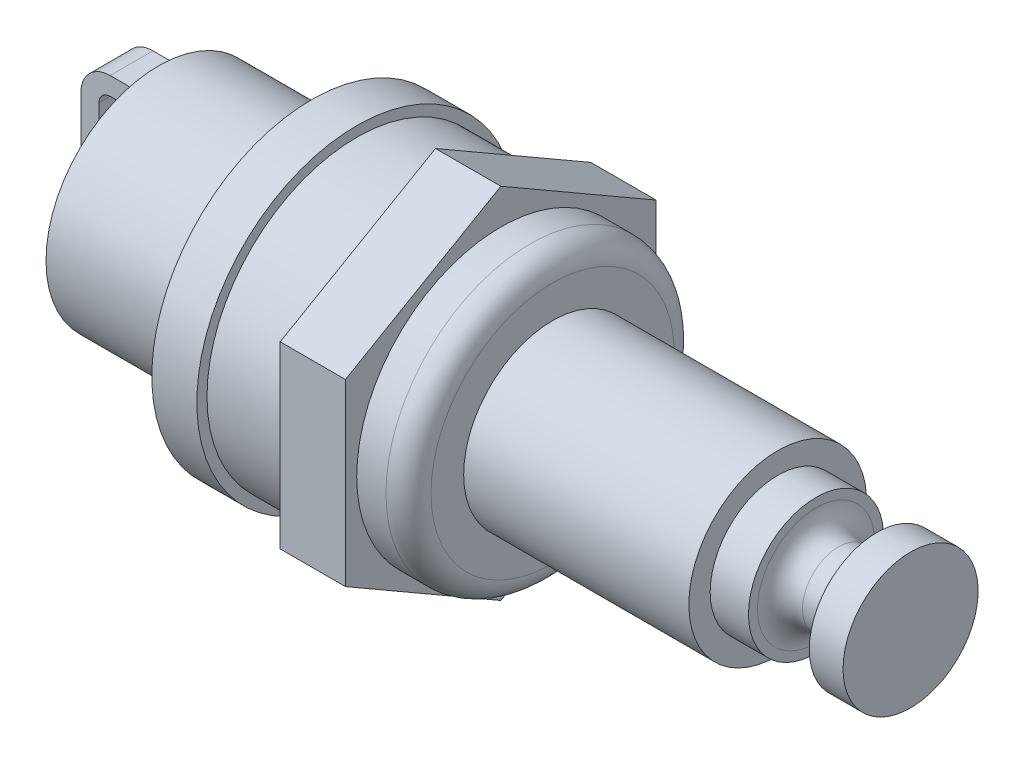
from build123d import *

# Parameters (mm, degrees)
BOSS_EXTRU_1_DEPTH = 2.9
BOSS_EXTRU_2_DEPTH = 0.95
ESQUISSE5_W        = 2
ESQUISSE5_H        = 2.1
CONG_1_R           = 1


with BuildPart() as part:
    # Esquisse1 → R_volution1 (revolve)
    with BuildSketch(Plane.XY, mode=Mode.PRIVATE) as r_volution1_sk:
        Polygon((0, 0), (0, 6.4), (2.3, 6.4), (2.3, 3.95), (12.3, 3.95), (12.3, 3), (18.2, 3), (18.2, 0), align=None)
        Polygon((-2.9, 0), (-2.9, 6.65), (-6.4, 6.65), (-6.4, 5), (-15.2, 5), (-15.2, 0), align=None)
    revolve(r_volution1_sk.sketch.rotate(Axis((0, 0, 0), (1, 0, 0)), 90), axis=Axis((0, 0, 0), (1, 0, 0)))

    # Esquisse2 → Boss.-Extru.1 (add)
    with BuildSketch(Plane.ZY):
        Polygon((6.9, 3.983716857), (0, 7.967433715), (-6.9, 3.983716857), (-6.9, -3.983716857), (0, -7.967433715), (6.9, -3.983716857), align=None)
    extrude(amount=BOSS_EXTRU_1_DEPTH)

    # Esquisse3 → Boss.-Extru.2 (add, symmetric)
    with BuildSketch(Plane.XY):
        with BuildLine():
            Line((-15.2, 4.5), (-16.4, 4.5))
            ThreePointArc((-16.4, 4.5), (-17.319238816, 4.119238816), (-17.7, 3.2))
            Line((-17.7, 3.2), (-17.7, 0.5))
            Line((-17.7, 0.5), (-16.9, 0.5))
            Line((-16.9, 0.5), (-16.9, 3.2))
            ThreePointArc((-16.9, 3.2), (-16.753553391, 3.553553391), (-16.4, 3.7))
            Line((-16.4, 3.7), (-15.2, 3.7))
            Line((-15.2, 3.7), (-15.2, 4.5))
        make_face()
    extrude(amount=BOSS_EXTRU_2_DEPTH, both=True)

    # Esquisse4 → Enl_vement de mati_re-R_volution1 (revolve, cut)
    with BuildSketch(Plane.XY, mode=Mode.PRIVATE) as enl_vement_de_mati_re_r_volution1_sk:
        with BuildLine():
            Line((14, 3), (16.7, 3))
            Line((16.7, 3), (16.7, 2.6))
            ThreePointArc((16.7, 2.6), (16.407106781, 1.892893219), (15.7, 1.6))
            Line((15.7, 1.6), (15, 1.6))
            ThreePointArc((15, 1.6), (14.292893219, 1.892893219), (14, 2.6))
            Line((14, 2.6), (14, 3))
        make_face()
    revolve(enl_vement_de_mati_re_r_volution1_sk.sketch.rotate(Axis((0, 0, 0), (1, 0, 0)), 90), axis=Axis((0, 0, 0), (1, 0, 0)), mode=Mode.SUBTRACT)

    # Cong_1
    cong_1_edges = [part.edges().sort_by_distance(p)[0] for p in [
        (2.3, 0, -6.4),
    ]]
    fillet(cong_1_edges, radius=CONG_1_R)


with BuildPart() as body_2:
    # Esquisse5 → R_volution3 (revolve)
    with BuildSketch(Plane.XY, mode=Mode.PRIVATE) as r_volution3_sk:
        with Locations((-7.4, 6.05)):
            Rectangle(ESQUISSE5_W, ESQUISSE5_H)
    revolve(r_volution3_sk.sketch.rotate(Axis((0, 0, 0), (-1, 0, 0)), 90), axis=Axis((0, 0, 0), (-1, 0, 0)))


solid = Compound([part.part, body_2.part])
